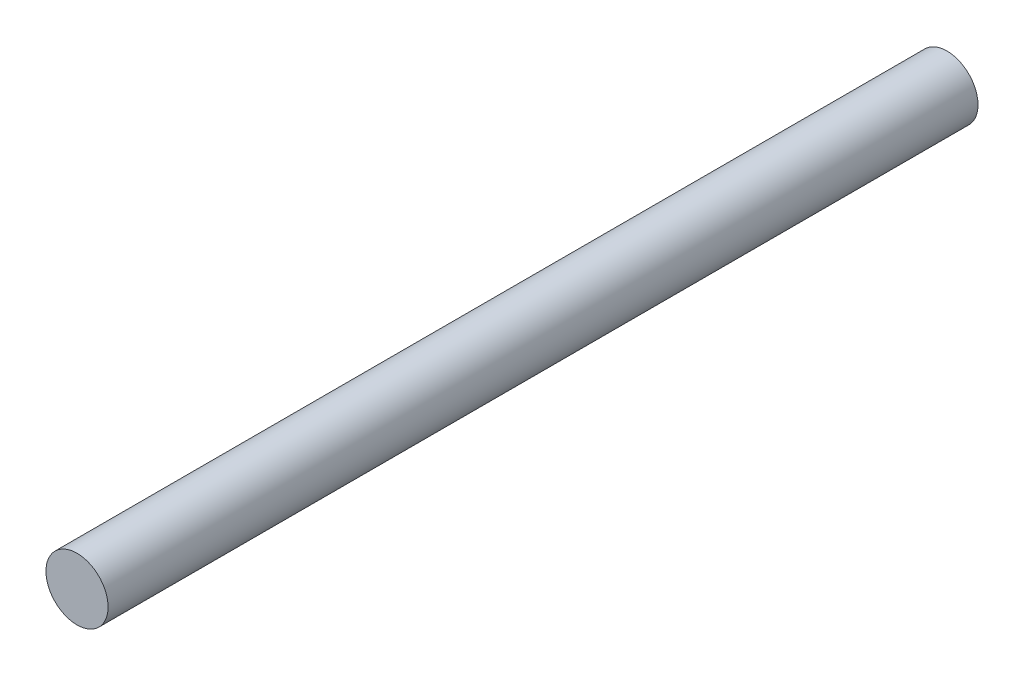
from build123d import *

# Parameters (mm, degrees)
SKETCH1_R           = 5
BOSS_EXTRUDE1_DEPTH = 70


with BuildPart() as part:
    # Sketch1 → Boss-Extrude1 (new, symmetric)
    with BuildSketch(Plane.XY):
        Circle(SKETCH1_R)
    extrude(amount=BOSS_EXTRUDE1_DEPTH, both=True)


solid = part.part
